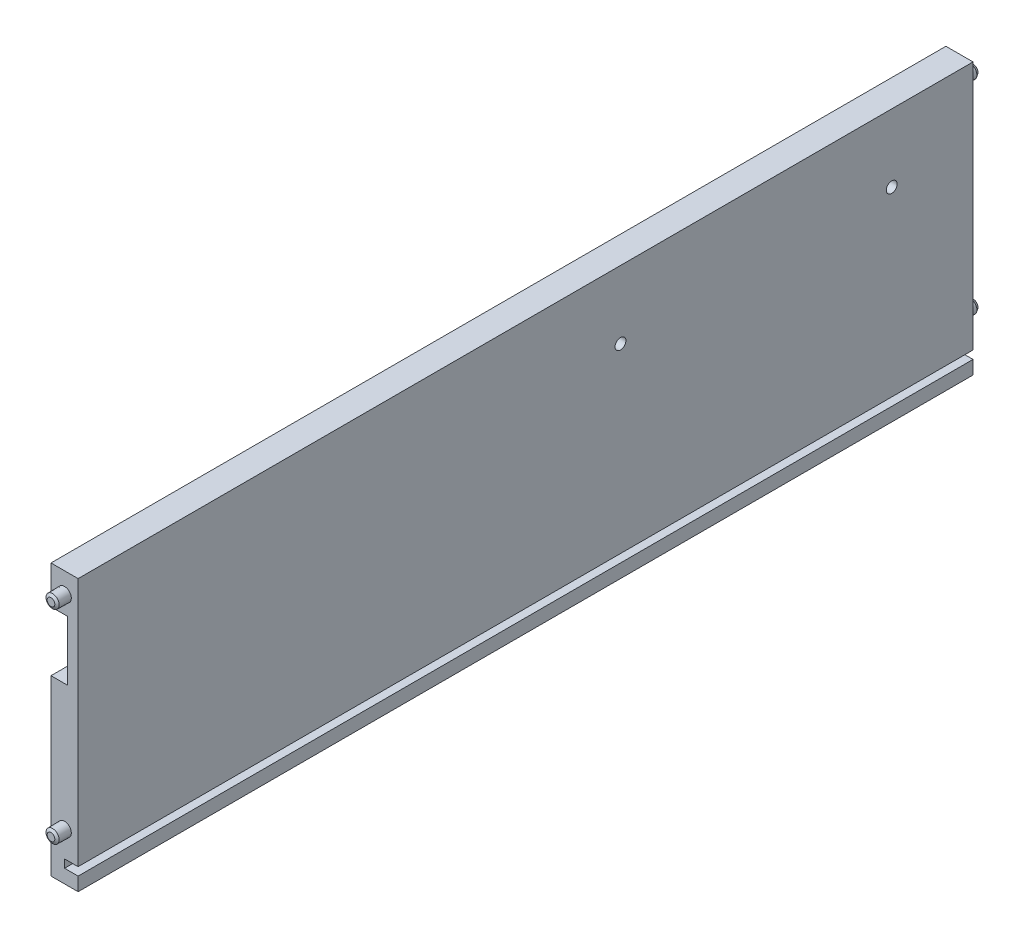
ISO-10303-21;
HEADER;
FILE_DESCRIPTION(('STEP AP214'),'2;1');
FILE_NAME('part.step','',(''),(''),'','','');
FILE_SCHEMA(('AUTOMOTIVE_DESIGN { 1 0 10303 214 1 1 1 1 }'));
ENDSEC;
DATA;
#1=APPLICATION_CONTEXT('core data for automotive mechanical design processes');
#2=APPLICATION_PROTOCOL_DEFINITION('international standard','automotive_design',2000,#1);
#3=PRODUCT_CONTEXT('',#1,'mechanical');
#4=PRODUCT('Part','Part','',(#3));
#5=PRODUCT_RELATED_PRODUCT_CATEGORY('part','',(#4));
#6=PRODUCT_DEFINITION_FORMATION('','',#4);
#7=PRODUCT_DEFINITION_CONTEXT('part definition',#1,'design');
#8=PRODUCT_DEFINITION('design','',#6,#7);
#9=PRODUCT_DEFINITION_SHAPE('','',#8);
#10=(LENGTH_UNIT() NAMED_UNIT(*) SI_UNIT(.MILLI.,.METRE.));
#11=(NAMED_UNIT(*) PLANE_ANGLE_UNIT() SI_UNIT($,.RADIAN.));
#12=(NAMED_UNIT(*) SI_UNIT($,.STERADIAN.) SOLID_ANGLE_UNIT());
#13=UNCERTAINTY_MEASURE_WITH_UNIT(LENGTH_MEASURE(1.E-05),#10,'distance_accuracy_value','');
#14=(GEOMETRIC_REPRESENTATION_CONTEXT(3) GLOBAL_UNCERTAINTY_ASSIGNED_CONTEXT((#13)) GLOBAL_UNIT_ASSIGNED_CONTEXT((#10,
#11,#12)) REPRESENTATION_CONTEXT('',''));
#15=CARTESIAN_POINT('',(0.,0.,0.));
#16=DIRECTION('',(0.,0.,1.));
#17=DIRECTION('',(1.,0.,0.));
#18=AXIS2_PLACEMENT_3D('',#15,#16,#17);
#19=CARTESIAN_POINT('',(10.,50.,-165.));
#20=DIRECTION('',(-1.,0.,0.));
#21=DIRECTION('',(0.,0.,1.));
#22=AXIS2_PLACEMENT_3D('',#19,#20,#21);
#23=PLANE('',#22);
#24=CARTESIAN_POINT('',(10.,24.9999999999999,-135.));
#25=DIRECTION('',(-1.,0.,0.));
#26=DIRECTION('',(0.,0.,1.));
#27=AXIS2_PLACEMENT_3D('',#24,#25,#26);
#28=CIRCLE('',#27,2.);
#29=CARTESIAN_POINT('',(10.,24.9999999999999,-133.));
#30=VERTEX_POINT('',#29);
#31=EDGE_CURVE('E162',#30,#30,#28,.T.);
#32=ORIENTED_EDGE('',*,*,#31,.T.);
#33=EDGE_LOOP('',(#32));
#34=FACE_BOUND('',#33,.T.);
#35=CARTESIAN_POINT('',(10.,24.9999999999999,-35.0000000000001));
#36=DIRECTION('',(-1.,0.,0.));
#37=DIRECTION('',(0.,0.,1.));
#38=AXIS2_PLACEMENT_3D('',#35,#36,#37);
#39=CIRCLE('',#38,2.);
#40=CARTESIAN_POINT('',(10.,24.9999999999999,-33.0000000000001));
#41=VERTEX_POINT('',#40);
#42=EDGE_CURVE('E156',#41,#41,#39,.T.);
#43=ORIENTED_EDGE('',*,*,#42,.T.);
#44=EDGE_LOOP('',(#43));
#45=FACE_BOUND('',#44,.T.);
#46=DIRECTION('',(0.,-1.,0.));
#47=VECTOR('',#46,1.);
#48=CARTESIAN_POINT('',(10.,-50.,165.));
#49=LINE('',#48,#47);
#50=CARTESIAN_POINT('',(10.,50.,165.));
#51=VERTEX_POINT('',#50);
#52=CARTESIAN_POINT('',(10.,-42.,165.));
#53=VERTEX_POINT('',#52);
#54=EDGE_CURVE('E196',#51,#53,#49,.T.);
#55=ORIENTED_EDGE('',*,*,#54,.T.);
#56=DIRECTION('',(0.,0.,1.));
#57=VECTOR('',#56,1.);
#58=CARTESIAN_POINT('',(10.,-42.,165.));
#59=LINE('',#58,#57);
#60=CARTESIAN_POINT('',(10.,-42.,-165.));
#61=VERTEX_POINT('',#60);
#62=EDGE_CURVE('E134',#61,#53,#59,.T.);
#63=ORIENTED_EDGE('',*,*,#62,.F.);
#64=DIRECTION('',(0.,1.,0.));
#65=VECTOR('',#64,1.);
#66=CARTESIAN_POINT('',(10.,-50.,-165.));
#67=LINE('',#66,#65);
#68=CARTESIAN_POINT('',(10.,50.,-165.));
#69=VERTEX_POINT('',#68);
#70=EDGE_CURVE('E194',#61,#69,#67,.T.);
#71=ORIENTED_EDGE('',*,*,#70,.T.);
#72=DIRECTION('',(0.,0.,1.));
#73=VECTOR('',#72,1.);
#74=CARTESIAN_POINT('',(10.,50.,165.));
#75=LINE('',#74,#73);
#76=EDGE_CURVE('E193',#69,#51,#75,.T.);
#77=ORIENTED_EDGE('',*,*,#76,.T.);
#78=EDGE_LOOP('',(#55,#63,#71,#77));
#79=FACE_BOUND('',#78,.T.);
#80=ADVANCED_FACE('F30',(#34,#45,#79),#23,.F.);
#81=CARTESIAN_POINT('',(10.,-50.,-165.));
#82=DIRECTION('',(0.,0.,1.));
#83=DIRECTION('',(1.,0.,0.));
#84=AXIS2_PLACEMENT_3D('',#81,#82,#83);
#85=PLANE('',#84);
#86=ORIENTED_EDGE('',*,*,#70,.F.);
#87=DIRECTION('',(1.,0.,0.));
#88=VECTOR('',#87,1.);
#89=CARTESIAN_POINT('',(5.,-42.,-165.));
#90=LINE('',#89,#88);
#91=CARTESIAN_POINT('',(5.,-42.,-165.));
#92=VERTEX_POINT('',#91);
#93=EDGE_CURVE('E141',#92,#61,#90,.T.);
#94=ORIENTED_EDGE('',*,*,#93,.F.);
#95=DIRECTION('',(0.,1.,0.));
#96=VECTOR('',#95,1.);
#97=CARTESIAN_POINT('',(5.,-42.,-165.));
#98=LINE('',#97,#96);
#99=CARTESIAN_POINT('',(5.,-45.,-165.));
#100=VERTEX_POINT('',#99);
#101=EDGE_CURVE('E124',#100,#92,#98,.T.);
#102=ORIENTED_EDGE('',*,*,#101,.F.);
#103=DIRECTION('',(1.,0.,0.));
#104=VECTOR('',#103,1.);
#105=CARTESIAN_POINT('',(5.,-45.,-165.));
#106=LINE('',#105,#104);
#107=CARTESIAN_POINT('',(10.,-45.,-165.));
#108=VERTEX_POINT('',#107);
#109=EDGE_CURVE('E121',#100,#108,#106,.T.);
#110=ORIENTED_EDGE('',*,*,#109,.T.);
#111=CARTESIAN_POINT('',(10.,-50.,-165.));
#112=VERTEX_POINT('',#111);
#113=EDGE_CURVE('E190',#112,#108,#67,.T.);
#114=ORIENTED_EDGE('',*,*,#113,.F.);
#115=DIRECTION('',(-1.,0.,0.));
#116=VECTOR('',#115,1.);
#117=CARTESIAN_POINT('',(10.,-50.,-165.));
#118=LINE('',#117,#116);
#119=CARTESIAN_POINT('',(0.,-50.,-165.));
#120=VERTEX_POINT('',#119);
#121=EDGE_CURVE('E201',#112,#120,#118,.T.);
#122=ORIENTED_EDGE('',*,*,#121,.T.);
#123=DIRECTION('',(0.,1.,0.));
#124=VECTOR('',#123,1.);
#125=CARTESIAN_POINT('',(0.,-50.,-165.));
#126=LINE('',#125,#124);
#127=CARTESIAN_POINT('',(0.,13.9999999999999,-165.));
#128=VERTEX_POINT('',#127);
#129=EDGE_CURVE('E202',#120,#128,#126,.T.);
#130=ORIENTED_EDGE('',*,*,#129,.T.);
#131=DIRECTION('',(-1.,0.,0.));
#132=VECTOR('',#131,1.);
#133=CARTESIAN_POINT('',(6.,13.9999999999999,-165.));
#134=LINE('',#133,#132);
#135=CARTESIAN_POINT('',(6.,13.9999999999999,-165.));
#136=VERTEX_POINT('',#135);
#137=EDGE_CURVE('E184',#136,#128,#134,.T.);
#138=ORIENTED_EDGE('',*,*,#137,.F.);
#139=DIRECTION('',(0.,-1.,0.));
#140=VECTOR('',#139,1.);
#141=CARTESIAN_POINT('',(6.,35.9999999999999,-165.));
#142=LINE('',#141,#140);
#143=CARTESIAN_POINT('',(6.,35.9999999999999,-165.));
#144=VERTEX_POINT('',#143);
#145=EDGE_CURVE('E173',#144,#136,#142,.T.);
#146=ORIENTED_EDGE('',*,*,#145,.F.);
#147=DIRECTION('',(-1.,0.,0.));
#148=VECTOR('',#147,1.);
#149=CARTESIAN_POINT('',(6.,35.9999999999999,-165.));
#150=LINE('',#149,#148);
#151=CARTESIAN_POINT('',(0.,35.9999999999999,-165.));
#152=VERTEX_POINT('',#151);
#153=EDGE_CURVE('E186',#144,#152,#150,.T.);
#154=ORIENTED_EDGE('',*,*,#153,.T.);
#155=CARTESIAN_POINT('',(0.,50.,-165.));
#156=VERTEX_POINT('',#155);
#157=EDGE_CURVE('E183',#152,#156,#126,.T.);
#158=ORIENTED_EDGE('',*,*,#157,.T.);
#159=DIRECTION('',(-1.,0.,0.));
#160=VECTOR('',#159,1.);
#161=CARTESIAN_POINT('',(10.,50.,-165.));
#162=LINE('',#161,#160);
#163=EDGE_CURVE('E221',#69,#156,#162,.T.);
#164=ORIENTED_EDGE('',*,*,#163,.F.);
#165=EDGE_LOOP('',(#86,#94,#102,#110,#114,#122,#130,#138,#146,#154,#158,#164));
#166=FACE_BOUND('',#165,.T.);
#167=CARTESIAN_POINT('',(5.,42.5,-165.));
#168=DIRECTION('',(0.,0.,1.));
#169=DIRECTION('',(1.,0.,0.));
#170=AXIS2_PLACEMENT_3D('',#167,#168,#169);
#171=CIRCLE('',#170,2.5);
#172=CARTESIAN_POINT('',(7.5,42.5,-165.));
#173=VERTEX_POINT('',#172);
#174=EDGE_CURVE('E224',#173,#173,#171,.F.);
#175=ORIENTED_EDGE('',*,*,#174,.F.);
#176=EDGE_LOOP('',(#175));
#177=FACE_BOUND('',#176,.T.);
#178=CARTESIAN_POINT('',(5.,-32.5,-165.));
#179=DIRECTION('',(0.,0.,1.));
#180=DIRECTION('',(1.,0.,0.));
#181=AXIS2_PLACEMENT_3D('',#178,#179,#180);
#182=CIRCLE('',#181,2.5);
#183=CARTESIAN_POINT('',(7.5,-32.5,-165.));
#184=VERTEX_POINT('',#183);
#185=EDGE_CURVE('E227',#184,#184,#182,.F.);
#186=ORIENTED_EDGE('',*,*,#185,.F.);
#187=EDGE_LOOP('',(#186));
#188=FACE_BOUND('',#187,.T.);
#189=ADVANCED_FACE('F266',(#166,#177,#188),#85,.F.);
#190=CARTESIAN_POINT('',(0.,50.,-165.));
#191=DIRECTION('',(-1.,0.,0.));
#192=DIRECTION('',(0.,0.,1.));
#193=AXIS2_PLACEMENT_3D('',#190,#191,#192);
#194=PLANE('',#193);
#195=DIRECTION('',(0.,0.,1.));
#196=VECTOR('',#195,1.);
#197=CARTESIAN_POINT('',(0.,13.9999999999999,-165.));
#198=LINE('',#197,#196);
#199=CARTESIAN_POINT('',(0.,13.9999999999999,165.));
#200=VERTEX_POINT('',#199);
#201=EDGE_CURVE('E170',#128,#200,#198,.T.);
#202=ORIENTED_EDGE('',*,*,#201,.F.);
#203=ORIENTED_EDGE('',*,*,#129,.F.);
#204=DIRECTION('',(0.,0.,-1.));
#205=VECTOR('',#204,1.);
#206=CARTESIAN_POINT('',(0.,-50.,165.));
#207=LINE('',#206,#205);
#208=CARTESIAN_POINT('',(0.,-50.,165.));
#209=VERTEX_POINT('',#208);
#210=EDGE_CURVE('E211',#209,#120,#207,.T.);
#211=ORIENTED_EDGE('',*,*,#210,.F.);
#212=DIRECTION('',(0.,-1.,0.));
#213=VECTOR('',#212,1.);
#214=CARTESIAN_POINT('',(0.,-50.,165.));
#215=LINE('',#214,#213);
#216=EDGE_CURVE('E207',#200,#209,#215,.T.);
#217=ORIENTED_EDGE('',*,*,#216,.F.);
#218=EDGE_LOOP('',(#202,#203,#211,#217));
#219=FACE_BOUND('',#218,.T.);
#220=ADVANCED_FACE('F273',(#219),#194,.T.);
#221=CARTESIAN_POINT('',(10.,50.,165.));
#222=DIRECTION('',(0.,-1.,0.));
#223=DIRECTION('',(0.,0.,-1.));
#224=AXIS2_PLACEMENT_3D('',#221,#222,#223);
#225=PLANE('',#224);
#226=DIRECTION('',(0.,0.,1.));
#227=VECTOR('',#226,1.);
#228=CARTESIAN_POINT('',(0.,50.,165.));
#229=LINE('',#228,#227);
#230=CARTESIAN_POINT('',(0.,50.,165.));
#231=VERTEX_POINT('',#230);
#232=EDGE_CURVE('E205',#156,#231,#229,.T.);
#233=ORIENTED_EDGE('',*,*,#232,.T.);
#234=DIRECTION('',(-1.,0.,0.));
#235=VECTOR('',#234,1.);
#236=CARTESIAN_POINT('',(10.,50.,165.));
#237=LINE('',#236,#235);
#238=EDGE_CURVE('E218',#51,#231,#237,.T.);
#239=ORIENTED_EDGE('',*,*,#238,.F.);
#240=ORIENTED_EDGE('',*,*,#76,.F.);
#241=ORIENTED_EDGE('',*,*,#163,.T.);
#242=EDGE_LOOP('',(#233,#239,#240,#241));
#243=FACE_BOUND('',#242,.T.);
#244=ADVANCED_FACE('F311',(#243),#225,.F.);
#245=CARTESIAN_POINT('',(10.,-50.,165.));
#246=DIRECTION('',(0.,0.,-1.));
#247=DIRECTION('',(-1.,0.,0.));
#248=AXIS2_PLACEMENT_3D('',#245,#246,#247);
#249=PLANE('',#248);
#250=CARTESIAN_POINT('',(5.,-32.5,165.));
#251=DIRECTION('',(0.,0.,-1.));
#252=DIRECTION('',(1.,0.,0.));
#253=AXIS2_PLACEMENT_3D('',#250,#251,#252);
#254=CIRCLE('',#253,2.5);
#255=CARTESIAN_POINT('',(7.5,-32.5,165.));
#256=VERTEX_POINT('',#255);
#257=EDGE_CURVE('E146',#256,#256,#254,.T.);
#258=ORIENTED_EDGE('',*,*,#257,.T.);
#259=EDGE_LOOP('',(#258));
#260=FACE_BOUND('',#259,.T.);
#261=CARTESIAN_POINT('',(5.,42.5,165.));
#262=DIRECTION('',(0.,0.,-1.));
#263=DIRECTION('',(-1.,0.,0.));
#264=AXIS2_PLACEMENT_3D('',#261,#262,#263);
#265=CIRCLE('',#264,2.5);
#266=CARTESIAN_POINT('',(2.5,42.5,165.));
#267=VERTEX_POINT('',#266);
#268=EDGE_CURVE('E149',#267,#267,#265,.T.);
#269=ORIENTED_EDGE('',*,*,#268,.T.);
#270=EDGE_LOOP('',(#269));
#271=FACE_BOUND('',#270,.T.);
#272=DIRECTION('',(0.,-1.,0.));
#273=VECTOR('',#272,1.);
#274=CARTESIAN_POINT('',(5.,-42.,165.));
#275=LINE('',#274,#273);
#276=CARTESIAN_POINT('',(5.,-42.,165.));
#277=VERTEX_POINT('',#276);
#278=CARTESIAN_POINT('',(5.,-45.,165.));
#279=VERTEX_POINT('',#278);
#280=EDGE_CURVE('E125',#277,#279,#275,.T.);
#281=ORIENTED_EDGE('',*,*,#280,.F.);
#282=DIRECTION('',(1.,0.,0.));
#283=VECTOR('',#282,1.);
#284=CARTESIAN_POINT('',(5.,-42.,165.));
#285=LINE('',#284,#283);
#286=EDGE_CURVE('E150',#277,#53,#285,.T.);
#287=ORIENTED_EDGE('',*,*,#286,.T.);
#288=ORIENTED_EDGE('',*,*,#54,.F.);
#289=ORIENTED_EDGE('',*,*,#238,.T.);
#290=CARTESIAN_POINT('',(0.,35.9999999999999,165.));
#291=VERTEX_POINT('',#290);
#292=EDGE_CURVE('E208',#231,#291,#215,.T.);
#293=ORIENTED_EDGE('',*,*,#292,.T.);
#294=DIRECTION('',(-1.,0.,0.));
#295=VECTOR('',#294,1.);
#296=CARTESIAN_POINT('',(6.,35.9999999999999,165.));
#297=LINE('',#296,#295);
#298=CARTESIAN_POINT('',(6.,35.9999999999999,165.));
#299=VERTEX_POINT('',#298);
#300=EDGE_CURVE('E53',#299,#291,#297,.T.);
#301=ORIENTED_EDGE('',*,*,#300,.F.);
#302=DIRECTION('',(0.,1.,0.));
#303=VECTOR('',#302,1.);
#304=CARTESIAN_POINT('',(6.,35.9999999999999,165.));
#305=LINE('',#304,#303);
#306=CARTESIAN_POINT('',(6.,13.9999999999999,165.));
#307=VERTEX_POINT('',#306);
#308=EDGE_CURVE('E166',#307,#299,#305,.T.);
#309=ORIENTED_EDGE('',*,*,#308,.F.);
#310=DIRECTION('',(-1.,0.,0.));
#311=VECTOR('',#310,1.);
#312=CARTESIAN_POINT('',(6.,13.9999999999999,165.));
#313=LINE('',#312,#311);
#314=EDGE_CURVE('E180',#307,#200,#313,.T.);
#315=ORIENTED_EDGE('',*,*,#314,.T.);
#316=ORIENTED_EDGE('',*,*,#216,.T.);
#317=DIRECTION('',(-1.,0.,0.));
#318=VECTOR('',#317,1.);
#319=CARTESIAN_POINT('',(10.,-50.,165.));
#320=LINE('',#319,#318);
#321=CARTESIAN_POINT('',(10.,-50.,165.));
#322=VERTEX_POINT('',#321);
#323=EDGE_CURVE('E215',#322,#209,#320,.T.);
#324=ORIENTED_EDGE('',*,*,#323,.F.);
#325=CARTESIAN_POINT('',(10.,-45.,165.));
#326=VERTEX_POINT('',#325);
#327=EDGE_CURVE('E139',#326,#322,#49,.T.);
#328=ORIENTED_EDGE('',*,*,#327,.F.);
#329=DIRECTION('',(1.,0.,0.));
#330=VECTOR('',#329,1.);
#331=CARTESIAN_POINT('',(5.,-45.,165.));
#332=LINE('',#331,#330);
#333=EDGE_CURVE('E45',#279,#326,#332,.T.);
#334=ORIENTED_EDGE('',*,*,#333,.F.);
#335=EDGE_LOOP('',(#281,#287,#288,#289,#293,#301,#309,#315,#316,#324,#328,#334));
#336=FACE_BOUND('',#335,.T.);
#337=ADVANCED_FACE('F137',(#260,#271,#336),#249,.F.);
#338=CARTESIAN_POINT('',(10.,-50.,165.));
#339=DIRECTION('',(0.,1.,0.));
#340=DIRECTION('',(0.,0.,1.));
#341=AXIS2_PLACEMENT_3D('',#338,#339,#340);
#342=PLANE('',#341);
#343=ORIENTED_EDGE('',*,*,#210,.T.);
#344=ORIENTED_EDGE('',*,*,#121,.F.);
#345=DIRECTION('',(0.,0.,-1.));
#346=VECTOR('',#345,1.);
#347=CARTESIAN_POINT('',(10.,-50.,165.));
#348=LINE('',#347,#346);
#349=EDGE_CURVE('E199',#322,#112,#348,.T.);
#350=ORIENTED_EDGE('',*,*,#349,.F.);
#351=ORIENTED_EDGE('',*,*,#323,.T.);
#352=EDGE_LOOP('',(#343,#344,#350,#351));
#353=FACE_BOUND('',#352,.T.);
#354=ADVANCED_FACE('F281',(#353),#342,.F.);
#355=ORIENTED_EDGE('',*,*,#113,.T.);
#356=DIRECTION('',(0.,0.,-1.));
#357=VECTOR('',#356,1.);
#358=CARTESIAN_POINT('',(10.,-45.,165.));
#359=LINE('',#358,#357);
#360=EDGE_CURVE('E292',#326,#108,#359,.T.);
#361=ORIENTED_EDGE('',*,*,#360,.F.);
#362=ORIENTED_EDGE('',*,*,#327,.T.);
#363=ORIENTED_EDGE('',*,*,#349,.T.);
#364=EDGE_LOOP('',(#355,#361,#362,#363));
#365=FACE_BOUND('',#364,.T.);
#366=ADVANCED_FACE('F269',(#365),#23,.F.);
#367=DIRECTION('',(0.,0.,-1.));
#368=VECTOR('',#367,1.);
#369=CARTESIAN_POINT('',(0.,35.9999999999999,-165.));
#370=LINE('',#369,#368);
#371=EDGE_CURVE('E165',#291,#152,#370,.T.);
#372=ORIENTED_EDGE('',*,*,#371,.F.);
#373=ORIENTED_EDGE('',*,*,#292,.F.);
#374=ORIENTED_EDGE('',*,*,#232,.F.);
#375=ORIENTED_EDGE('',*,*,#157,.F.);
#376=EDGE_LOOP('',(#372,#373,#374,#375));
#377=FACE_BOUND('',#376,.T.);
#378=ADVANCED_FACE('F280',(#377),#194,.T.);
#379=CARTESIAN_POINT('',(6.,13.9999999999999,-165.));
#380=DIRECTION('',(0.,-1.,0.));
#381=DIRECTION('',(0.,0.,-1.));
#382=AXIS2_PLACEMENT_3D('',#379,#380,#381);
#383=PLANE('',#382);
#384=ORIENTED_EDGE('',*,*,#201,.T.);
#385=ORIENTED_EDGE('',*,*,#314,.F.);
#386=DIRECTION('',(0.,0.,1.));
#387=VECTOR('',#386,1.);
#388=CARTESIAN_POINT('',(6.,13.9999999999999,-165.));
#389=LINE('',#388,#387);
#390=EDGE_CURVE('E175',#136,#307,#389,.T.);
#391=ORIENTED_EDGE('',*,*,#390,.F.);
#392=ORIENTED_EDGE('',*,*,#137,.T.);
#393=EDGE_LOOP('',(#384,#385,#391,#392));
#394=FACE_BOUND('',#393,.T.);
#395=ADVANCED_FACE('F287',(#394),#383,.F.);
#396=CARTESIAN_POINT('',(6.,35.9999999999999,-165.));
#397=DIRECTION('',(0.,1.,0.));
#398=DIRECTION('',(0.,0.,1.));
#399=AXIS2_PLACEMENT_3D('',#396,#397,#398);
#400=PLANE('',#399);
#401=ORIENTED_EDGE('',*,*,#371,.T.);
#402=ORIENTED_EDGE('',*,*,#153,.F.);
#403=DIRECTION('',(0.,0.,-1.));
#404=VECTOR('',#403,1.);
#405=CARTESIAN_POINT('',(6.,35.9999999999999,-165.));
#406=LINE('',#405,#404);
#407=EDGE_CURVE('E169',#299,#144,#406,.T.);
#408=ORIENTED_EDGE('',*,*,#407,.F.);
#409=ORIENTED_EDGE('',*,*,#300,.T.);
#410=EDGE_LOOP('',(#401,#402,#408,#409));
#411=FACE_BOUND('',#410,.T.);
#412=ADVANCED_FACE('F314',(#411),#400,.F.);
#413=CARTESIAN_POINT('',(6.,13.9999999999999,165.));
#414=DIRECTION('',(-1.,0.,0.));
#415=DIRECTION('',(0.,0.,1.));
#416=AXIS2_PLACEMENT_3D('',#413,#414,#415);
#417=PLANE('',#416);
#418=CARTESIAN_POINT('',(6.,24.9999999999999,-35.0000000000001));
#419=DIRECTION('',(-1.,0.,0.));
#420=DIRECTION('',(0.,0.,-1.));
#421=AXIS2_PLACEMENT_3D('',#418,#419,#420);
#422=CIRCLE('',#421,2.);
#423=CARTESIAN_POINT('',(6.,24.9999999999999,-37.0000000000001));
#424=VERTEX_POINT('',#423);
#425=EDGE_CURVE('E153',#424,#424,#422,.T.);
#426=ORIENTED_EDGE('',*,*,#425,.F.);
#427=EDGE_LOOP('',(#426));
#428=FACE_BOUND('',#427,.T.);
#429=CARTESIAN_POINT('',(6.,24.9999999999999,-135.));
#430=DIRECTION('',(-1.,0.,0.));
#431=DIRECTION('',(0.,0.,1.));
#432=AXIS2_PLACEMENT_3D('',#429,#430,#431);
#433=CIRCLE('',#432,2.);
#434=CARTESIAN_POINT('',(6.,24.9999999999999,-133.));
#435=VERTEX_POINT('',#434);
#436=EDGE_CURVE('E159',#435,#435,#433,.T.);
#437=ORIENTED_EDGE('',*,*,#436,.F.);
#438=EDGE_LOOP('',(#437));
#439=FACE_BOUND('',#438,.T.);
#440=ORIENTED_EDGE('',*,*,#308,.T.);
#441=ORIENTED_EDGE('',*,*,#407,.T.);
#442=ORIENTED_EDGE('',*,*,#145,.T.);
#443=ORIENTED_EDGE('',*,*,#390,.T.);
#444=EDGE_LOOP('',(#440,#441,#442,#443));
#445=FACE_BOUND('',#444,.T.);
#446=ADVANCED_FACE('F319',(#428,#439,#445),#417,.T.);
#447=CARTESIAN_POINT('',(16.,24.9999999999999,-135.));
#448=DIRECTION('',(-1.,0.,0.));
#449=DIRECTION('',(0.,0.,1.));
#450=AXIS2_PLACEMENT_3D('',#447,#448,#449);
#451=CYLINDRICAL_SURFACE('',#450,2.);
#452=ORIENTED_EDGE('',*,*,#436,.T.);
#453=EDGE_LOOP('',(#452));
#454=FACE_BOUND('',#453,.T.);
#455=ORIENTED_EDGE('',*,*,#31,.F.);
#456=EDGE_LOOP('',(#455));
#457=FACE_BOUND('',#456,.T.);
#458=ADVANCED_FACE('F384',(#454,#457),#451,.F.);
#459=CARTESIAN_POINT('',(16.,24.9999999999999,-35.0000000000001));
#460=DIRECTION('',(-1.,0.,0.));
#461=DIRECTION('',(0.,0.,1.));
#462=AXIS2_PLACEMENT_3D('',#459,#460,#461);
#463=CYLINDRICAL_SURFACE('',#462,2.);
#464=ORIENTED_EDGE('',*,*,#425,.T.);
#465=EDGE_LOOP('',(#464));
#466=FACE_BOUND('',#465,.T.);
#467=ORIENTED_EDGE('',*,*,#42,.F.);
#468=EDGE_LOOP('',(#467));
#469=FACE_BOUND('',#468,.T.);
#470=ADVANCED_FACE('F380',(#466,#469),#463,.F.);
#471=CARTESIAN_POINT('',(5.,42.5,-165.));
#472=DIRECTION('',(0.,0.,1.));
#473=DIRECTION('',(-1.,0.,0.));
#474=AXIS2_PLACEMENT_3D('',#471,#472,#473);
#475=CONICAL_SURFACE('',#474,2.5,0.0174532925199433);
#476=CARTESIAN_POINT('',(5.,42.5,-169.000152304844));
#477=DIRECTION('',(0.,0.,1.));
#478=DIRECTION('',(1.,0.,0.));
#479=AXIS2_PLACEMENT_3D('',#476,#477,#478);
#480=CIRCLE('',#479,2.4301770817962);
#481=CARTESIAN_POINT('',(7.4301770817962,42.5,-169.000152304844));
#482=VERTEX_POINT('',#481);
#483=EDGE_CURVE('E245',#482,#482,#480,.T.);
#484=ORIENTED_EDGE('',*,*,#483,.T.);
#485=EDGE_LOOP('',(#484));
#486=FACE_BOUND('',#485,.T.);
#487=ORIENTED_EDGE('',*,*,#174,.T.);
#488=EDGE_LOOP('',(#487));
#489=FACE_BOUND('',#488,.T.);
#490=ADVANCED_FACE('F376',(#486,#489),#475,.T.);
#491=CARTESIAN_POINT('',(5.,42.5,-170.));
#492=DIRECTION('',(0.,0.,-1.));
#493=DIRECTION('',(-1.,0.,0.));
#494=AXIS2_PLACEMENT_3D('',#491,#492,#493);
#495=PLANE('',#494);
#496=CARTESIAN_POINT('',(5.,42.5,-170.));
#497=DIRECTION('',(0.,0.,-1.));
#498=DIRECTION('',(-1.,0.,0.));
#499=AXIS2_PLACEMENT_3D('',#496,#497,#498);
#500=CIRCLE('',#499,1.82940797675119);
#501=CARTESIAN_POINT('',(3.17059202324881,42.5,-170.));
#502=VERTEX_POINT('',#501);
#503=EDGE_CURVE('E242',#502,#502,#500,.T.);
#504=ORIENTED_EDGE('',*,*,#503,.T.);
#505=EDGE_LOOP('',(#504));
#506=FACE_BOUND('',#505,.T.);
#507=ADVANCED_FACE('F372',(#506),#495,.T.);
#508=CARTESIAN_POINT('',(5.,-32.5,-165.));
#509=DIRECTION('',(0.,0.,1.));
#510=DIRECTION('',(1.,0.,0.));
#511=AXIS2_PLACEMENT_3D('',#508,#509,#510);
#512=CONICAL_SURFACE('',#511,2.5,0.0174532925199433);
#513=CARTESIAN_POINT('',(5.,-32.5,-169.000152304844));
#514=DIRECTION('',(0.,0.,-1.));
#515=DIRECTION('',(-1.,0.,0.));
#516=AXIS2_PLACEMENT_3D('',#513,#514,#515);
#517=CIRCLE('',#516,2.4301770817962);
#518=CARTESIAN_POINT('',(2.5698229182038,-32.5,-169.000152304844));
#519=VERTEX_POINT('',#518);
#520=EDGE_CURVE('E11',#519,#519,#517,.F.);
#521=ORIENTED_EDGE('',*,*,#520,.T.);
#522=EDGE_LOOP('',(#521));
#523=FACE_BOUND('',#522,.T.);
#524=ORIENTED_EDGE('',*,*,#185,.T.);
#525=EDGE_LOOP('',(#524));
#526=FACE_BOUND('',#525,.T.);
#527=ADVANCED_FACE('F367',(#523,#526),#512,.T.);
#528=CARTESIAN_POINT('',(5.,-32.5,-170.));
#529=DIRECTION('',(0.,0.,1.));
#530=DIRECTION('',(1.,0.,0.));
#531=AXIS2_PLACEMENT_3D('',#528,#529,#530);
#532=PLANE('',#531);
#533=CARTESIAN_POINT('',(5.,-32.5,-170.));
#534=DIRECTION('',(0.,0.,1.));
#535=DIRECTION('',(1.,0.,0.));
#536=AXIS2_PLACEMENT_3D('',#533,#534,#535);
#537=CIRCLE('',#536,1.82940797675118);
#538=CARTESIAN_POINT('',(6.82940797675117,-32.5,-170.));
#539=VERTEX_POINT('',#538);
#540=EDGE_CURVE('E38',#539,#539,#537,.F.);
#541=ORIENTED_EDGE('',*,*,#540,.T.);
#542=EDGE_LOOP('',(#541));
#543=FACE_BOUND('',#542,.T.);
#544=ADVANCED_FACE('F250',(#543),#532,.F.);
#545=CARTESIAN_POINT('',(5.,42.5,165.));
#546=DIRECTION('',(0.,0.,-1.));
#547=DIRECTION('',(-1.,0.,0.));
#548=AXIS2_PLACEMENT_3D('',#545,#546,#547);
#549=CONICAL_SURFACE('',#548,2.5,0.0174532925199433);
#550=CARTESIAN_POINT('',(5.,42.5,169.416772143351));
#551=DIRECTION('',(0.,0.,1.));
#552=DIRECTION('',(1.,0.,0.));
#553=AXIS2_PLACEMENT_3D('',#550,#551,#552);
#554=CIRCLE('',#553,2.42290495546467);
#555=CARTESIAN_POINT('',(7.42290495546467,42.5,169.416772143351));
#556=VERTEX_POINT('',#555);
#557=EDGE_CURVE('E230',#556,#556,#554,.F.);
#558=ORIENTED_EDGE('',*,*,#557,.T.);
#559=EDGE_LOOP('',(#558));
#560=FACE_BOUND('',#559,.T.);
#561=ORIENTED_EDGE('',*,*,#268,.F.);
#562=EDGE_LOOP('',(#561));
#563=FACE_BOUND('',#562,.T.);
#564=ADVANCED_FACE('F357',(#560,#563),#549,.T.);
#565=CARTESIAN_POINT('',(5.,42.5,170.));
#566=DIRECTION('',(0.,0.,1.));
#567=DIRECTION('',(-1.,0.,0.));
#568=AXIS2_PLACEMENT_3D('',#565,#566,#567);
#569=PLANE('',#568);
#570=CARTESIAN_POINT('',(5.,42.5,170.));
#571=DIRECTION('',(0.,0.,1.));
#572=DIRECTION('',(1.,0.,0.));
#573=AXIS2_PLACEMENT_3D('',#570,#571,#572);
#574=CIRCLE('',#573,1.41272467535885);
#575=CARTESIAN_POINT('',(6.41272467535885,42.5,170.));
#576=VERTEX_POINT('',#575);
#577=EDGE_CURVE('E233',#576,#576,#574,.T.);
#578=ORIENTED_EDGE('',*,*,#577,.T.);
#579=EDGE_LOOP('',(#578));
#580=FACE_BOUND('',#579,.T.);
#581=ADVANCED_FACE('F351',(#580),#569,.T.);
#582=CARTESIAN_POINT('',(5.,-32.5,165.));
#583=DIRECTION('',(0.,0.,-1.));
#584=DIRECTION('',(1.,0.,0.));
#585=AXIS2_PLACEMENT_3D('',#582,#583,#584);
#586=CONICAL_SURFACE('',#585,2.5,0.0174532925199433);
#587=CARTESIAN_POINT('',(5.,-32.5,169.416772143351));
#588=DIRECTION('',(0.,0.,-1.));
#589=DIRECTION('',(-1.,0.,0.));
#590=AXIS2_PLACEMENT_3D('',#587,#588,#589);
#591=CIRCLE('',#590,2.42290495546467);
#592=CARTESIAN_POINT('',(2.57709504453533,-32.5,169.416772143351));
#593=VERTEX_POINT('',#592);
#594=EDGE_CURVE('E236',#593,#593,#591,.T.);
#595=ORIENTED_EDGE('',*,*,#594,.T.);
#596=EDGE_LOOP('',(#595));
#597=FACE_BOUND('',#596,.T.);
#598=ORIENTED_EDGE('',*,*,#257,.F.);
#599=EDGE_LOOP('',(#598));
#600=FACE_BOUND('',#599,.T.);
#601=ADVANCED_FACE('F348',(#597,#600),#586,.T.);
#602=CARTESIAN_POINT('',(5.,-32.5,170.));
#603=DIRECTION('',(0.,0.,-1.));
#604=DIRECTION('',(1.,0.,0.));
#605=AXIS2_PLACEMENT_3D('',#602,#603,#604);
#606=PLANE('',#605);
#607=CARTESIAN_POINT('',(5.,-32.5,170.));
#608=DIRECTION('',(0.,0.,-1.));
#609=DIRECTION('',(-1.,0.,0.));
#610=AXIS2_PLACEMENT_3D('',#607,#608,#609);
#611=CIRCLE('',#610,1.41272467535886);
#612=CARTESIAN_POINT('',(3.58727532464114,-32.5,170.));
#613=VERTEX_POINT('',#612);
#614=EDGE_CURVE('E239',#613,#613,#611,.F.);
#615=ORIENTED_EDGE('',*,*,#614,.T.);
#616=EDGE_LOOP('',(#615));
#617=FACE_BOUND('',#616,.T.);
#618=ADVANCED_FACE('F338',(#617),#606,.F.);
#619=CARTESIAN_POINT('',(5.,42.5,169.416772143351));
#620=DIRECTION('',(0.,0.,-1.));
#621=DIRECTION('',(-1.,0.,0.));
#622=AXIS2_PLACEMENT_3D('',#619,#620,#621);
#623=CONICAL_SURFACE('',#622,2.42290495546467,1.04719755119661);
#624=ORIENTED_EDGE('',*,*,#577,.F.);
#625=EDGE_LOOP('',(#624));
#626=FACE_BOUND('',#625,.T.);
#627=ORIENTED_EDGE('',*,*,#557,.F.);
#628=EDGE_LOOP('',(#627));
#629=FACE_BOUND('',#628,.T.);
#630=ADVANCED_FACE('F335',(#626,#629),#623,.T.);
#631=CARTESIAN_POINT('',(5.,-32.5,169.416772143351));
#632=DIRECTION('',(0.,0.,-1.));
#633=DIRECTION('',(-1.,0.,0.));
#634=AXIS2_PLACEMENT_3D('',#631,#632,#633);
#635=CONICAL_SURFACE('',#634,2.42290495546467,1.0471975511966);
#636=ORIENTED_EDGE('',*,*,#614,.F.);
#637=EDGE_LOOP('',(#636));
#638=FACE_BOUND('',#637,.T.);
#639=ORIENTED_EDGE('',*,*,#594,.F.);
#640=EDGE_LOOP('',(#639));
#641=FACE_BOUND('',#640,.T.);
#642=ADVANCED_FACE('F262',(#638,#641),#635,.T.);
#643=CARTESIAN_POINT('',(5.,42.5,-170.));
#644=DIRECTION('',(0.,0.,1.));
#645=DIRECTION('',(1.,0.,0.));
#646=AXIS2_PLACEMENT_3D('',#643,#644,#645);
#647=CONICAL_SURFACE('',#646,1.82940797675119,0.541052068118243);
#648=ORIENTED_EDGE('',*,*,#483,.F.);
#649=EDGE_LOOP('',(#648));
#650=FACE_BOUND('',#649,.T.);
#651=ORIENTED_EDGE('',*,*,#503,.F.);
#652=EDGE_LOOP('',(#651));
#653=FACE_BOUND('',#652,.T.);
#654=ADVANCED_FACE('F254',(#650,#653),#647,.T.);
#655=CARTESIAN_POINT('',(5.,-32.5,-170.));
#656=DIRECTION('',(0.,0.,1.));
#657=DIRECTION('',(1.,0.,0.));
#658=AXIS2_PLACEMENT_3D('',#655,#656,#657);
#659=CONICAL_SURFACE('',#658,1.82940797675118,0.541052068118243);
#660=ORIENTED_EDGE('',*,*,#520,.F.);
#661=EDGE_LOOP('',(#660));
#662=FACE_BOUND('',#661,.T.);
#663=ORIENTED_EDGE('',*,*,#540,.F.);
#664=EDGE_LOOP('',(#663));
#665=FACE_BOUND('',#664,.T.);
#666=ADVANCED_FACE('F32',(#662,#665),#659,.T.);
#667=CARTESIAN_POINT('',(5.,-42.,165.));
#668=DIRECTION('',(0.,1.,0.));
#669=DIRECTION('',(0.,0.,1.));
#670=AXIS2_PLACEMENT_3D('',#667,#668,#669);
#671=PLANE('',#670);
#672=ORIENTED_EDGE('',*,*,#62,.T.);
#673=ORIENTED_EDGE('',*,*,#286,.F.);
#674=DIRECTION('',(0.,0.,1.));
#675=VECTOR('',#674,1.);
#676=CARTESIAN_POINT('',(5.,-42.,165.));
#677=LINE('',#676,#675);
#678=EDGE_CURVE('E131',#92,#277,#677,.T.);
#679=ORIENTED_EDGE('',*,*,#678,.F.);
#680=ORIENTED_EDGE('',*,*,#93,.T.);
#681=EDGE_LOOP('',(#672,#673,#679,#680));
#682=FACE_BOUND('',#681,.T.);
#683=ADVANCED_FACE('F253',(#682),#671,.F.);
#684=CARTESIAN_POINT('',(5.,-45.,165.));
#685=DIRECTION('',(0.,-1.,0.));
#686=DIRECTION('',(0.,0.,-1.));
#687=AXIS2_PLACEMENT_3D('',#684,#685,#686);
#688=PLANE('',#687);
#689=ORIENTED_EDGE('',*,*,#360,.T.);
#690=ORIENTED_EDGE('',*,*,#109,.F.);
#691=DIRECTION('',(0.,0.,-1.));
#692=VECTOR('',#691,1.);
#693=CARTESIAN_POINT('',(5.,-45.,165.));
#694=LINE('',#693,#692);
#695=EDGE_CURVE('E117',#279,#100,#694,.T.);
#696=ORIENTED_EDGE('',*,*,#695,.F.);
#697=ORIENTED_EDGE('',*,*,#333,.T.);
#698=EDGE_LOOP('',(#689,#690,#696,#697));
#699=FACE_BOUND('',#698,.T.);
#700=ADVANCED_FACE('F119',(#699),#688,.F.);
#701=CARTESIAN_POINT('',(5.,-45.,165.));
#702=DIRECTION('',(1.,0.,0.));
#703=DIRECTION('',(0.,0.,-1.));
#704=AXIS2_PLACEMENT_3D('',#701,#702,#703);
#705=PLANE('',#704);
#706=ORIENTED_EDGE('',*,*,#280,.T.);
#707=ORIENTED_EDGE('',*,*,#695,.T.);
#708=ORIENTED_EDGE('',*,*,#101,.T.);
#709=ORIENTED_EDGE('',*,*,#678,.T.);
#710=EDGE_LOOP('',(#706,#707,#708,#709));
#711=FACE_BOUND('',#710,.T.);
#712=ADVANCED_FACE('F129',(#711),#705,.T.);
#713=CLOSED_SHELL('',(#80,#189,#220,#244,#337,#354,#366,#378,#395,#412,#446,#458,#470,#490,#507,
#527,#544,#564,#581,#601,#618,#630,#642,#654,#666,#683,#700,#712));
#714=MANIFOLD_SOLID_BREP('B2',#713);
#715=ADVANCED_BREP_SHAPE_REPRESENTATION('',(#18,#714),#14);
#716=SHAPE_DEFINITION_REPRESENTATION(#9,#715);
ENDSEC;
END-ISO-10303-21;
